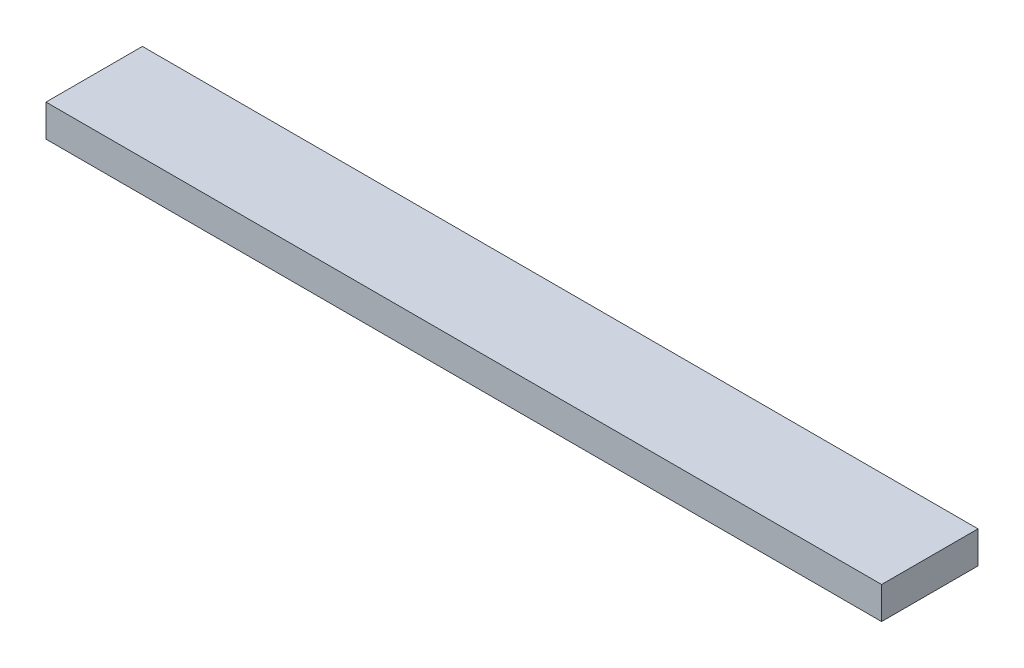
from build123d import *

# Parameters (mm, degrees)
SKETCH1_W              = 82.55
SKETCH1_H              = 9.525
POPSICLE_STICK_1_DEPTH = 3.175


with BuildPart() as part:
    # Sketch1 → Popsicle stick 1 (new body)
    with BuildSketch(Plane(origin=(0, 0, 0), x_dir=(1, 0, 0), z_dir=(0, 1, 0))):
        with Locations((41.275, 4.7625)):
            Rectangle(SKETCH1_W, SKETCH1_H)
    extrude(amount=POPSICLE_STICK_1_DEPTH)


solid = part.part
